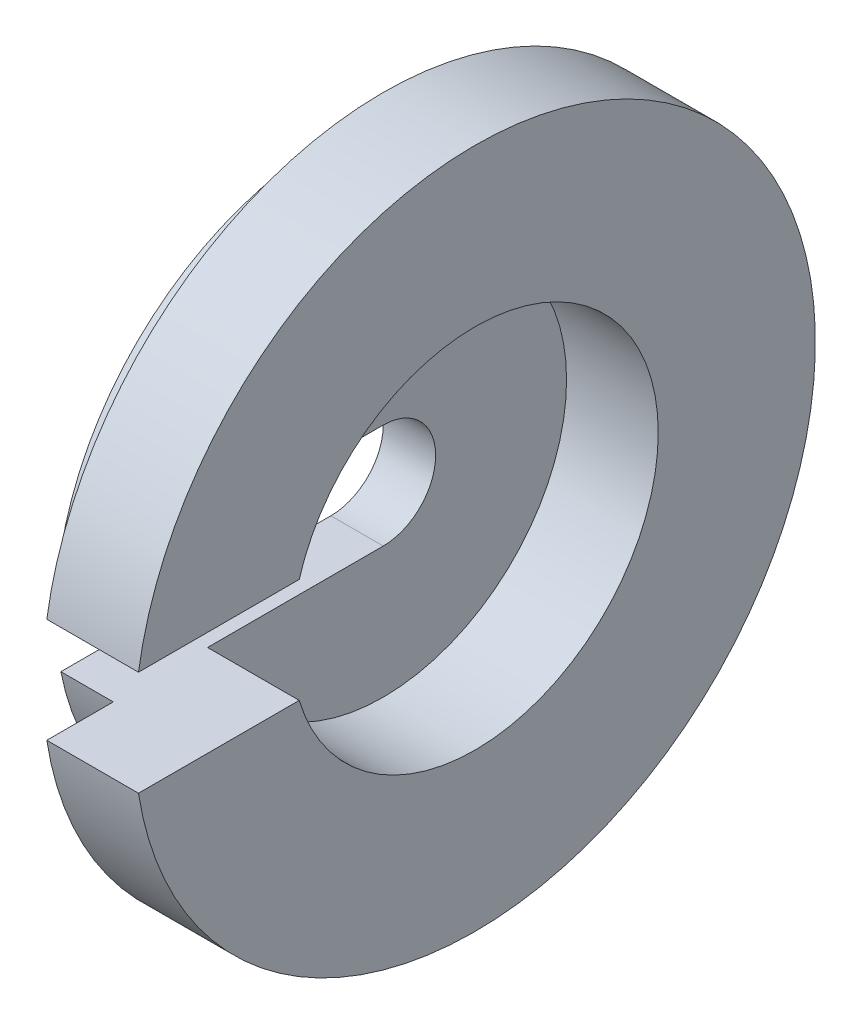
ISO-10303-21;
HEADER;
FILE_DESCRIPTION(('STEP AP214'),'2;1');
FILE_NAME('part.step','',(''),(''),'','','');
FILE_SCHEMA(('AUTOMOTIVE_DESIGN { 1 0 10303 214 1 1 1 1 }'));
ENDSEC;
DATA;
#1=APPLICATION_CONTEXT('core data for automotive mechanical design processes');
#2=APPLICATION_PROTOCOL_DEFINITION('international standard','automotive_design',2000,#1);
#3=PRODUCT_CONTEXT('',#1,'mechanical');
#4=PRODUCT('Part','Part','',(#3));
#5=PRODUCT_RELATED_PRODUCT_CATEGORY('part','',(#4));
#6=PRODUCT_DEFINITION_FORMATION('','',#4);
#7=PRODUCT_DEFINITION_CONTEXT('part definition',#1,'design');
#8=PRODUCT_DEFINITION('design','',#6,#7);
#9=PRODUCT_DEFINITION_SHAPE('','',#8);
#10=(LENGTH_UNIT() NAMED_UNIT(*) SI_UNIT(.MILLI.,.METRE.));
#11=(NAMED_UNIT(*) PLANE_ANGLE_UNIT() SI_UNIT($,.RADIAN.));
#12=(NAMED_UNIT(*) SI_UNIT($,.STERADIAN.) SOLID_ANGLE_UNIT());
#13=UNCERTAINTY_MEASURE_WITH_UNIT(LENGTH_MEASURE(1.E-05),#10,'distance_accuracy_value','');
#14=(GEOMETRIC_REPRESENTATION_CONTEXT(3) GLOBAL_UNCERTAINTY_ASSIGNED_CONTEXT((#13)) GLOBAL_UNIT_ASSIGNED_CONTEXT((#10,
#11,#12)) REPRESENTATION_CONTEXT('',''));
#15=CARTESIAN_POINT('',(0.,0.,0.));
#16=DIRECTION('',(0.,0.,1.));
#17=DIRECTION('',(1.,0.,0.));
#18=AXIS2_PLACEMENT_3D('',#15,#16,#17);
#19=CARTESIAN_POINT('',(0.,0.,0.));
#20=DIRECTION('',(1.,0.,0.));
#21=DIRECTION('',(0.,0.,-1.));
#22=AXIS2_PLACEMENT_3D('',#19,#20,#21);
#23=PLANE('',#22);
#24=CARTESIAN_POINT('',(0.,0.,0.));
#25=DIRECTION('',(1.,0.,0.));
#26=DIRECTION('',(0.,0.,-1.));
#27=AXIS2_PLACEMENT_3D('',#24,#25,#26);
#28=CIRCLE('',#27,2.);
#29=CARTESIAN_POINT('',(0.,-2.,0.));
#30=VERTEX_POINT('',#29);
#31=CARTESIAN_POINT('',(0.,2.,0.));
#32=VERTEX_POINT('',#31);
#33=EDGE_CURVE('E20',#30,#32,#28,.T.);
#34=ORIENTED_EDGE('',*,*,#33,.T.);
#35=DIRECTION('',(0.,0.,1.));
#36=VECTOR('',#35,1.);
#37=CARTESIAN_POINT('',(0.,2.,0.));
#38=LINE('',#37,#36);
#39=CARTESIAN_POINT('',(0.,2.,10.3077640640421));
#40=VERTEX_POINT('',#39);
#41=EDGE_CURVE('E80',#32,#40,#38,.T.);
#42=ORIENTED_EDGE('',*,*,#41,.T.);
#43=CARTESIAN_POINT('',(0.,0.,0.));
#44=DIRECTION('',(1.,0.,0.));
#45=DIRECTION('',(0.,0.,-1.));
#46=AXIS2_PLACEMENT_3D('',#43,#44,#45);
#47=CIRCLE('',#46,10.5);
#48=CARTESIAN_POINT('',(0.,-2.,10.3077640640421));
#49=VERTEX_POINT('',#48);
#50=EDGE_CURVE('E120',#49,#40,#47,.T.);
#51=ORIENTED_EDGE('',*,*,#50,.F.);
#52=DIRECTION('',(0.,0.,-1.));
#53=VECTOR('',#52,1.);
#54=CARTESIAN_POINT('',(0.,-2.,12.84523257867));
#55=LINE('',#54,#53);
#56=EDGE_CURVE('E83',#49,#30,#55,.T.);
#57=ORIENTED_EDGE('',*,*,#56,.T.);
#58=EDGE_LOOP('',(#34,#42,#51,#57));
#59=FACE_BOUND('',#58,.T.);
#60=ADVANCED_FACE('F16',(#59),#23,.F.);
#61=CARTESIAN_POINT('',(0.,0.,0.));
#62=DIRECTION('',(1.,0.,0.));
#63=DIRECTION('',(0.,0.,-1.));
#64=AXIS2_PLACEMENT_3D('',#61,#62,#63);
#65=CYLINDRICAL_SURFACE('',#64,2.);
#66=CARTESIAN_POINT('',(2.,0.,0.));
#67=DIRECTION('',(1.,0.,0.));
#68=DIRECTION('',(0.,0.,-1.));
#69=AXIS2_PLACEMENT_3D('',#66,#67,#68);
#70=CIRCLE('',#69,2.);
#71=CARTESIAN_POINT('',(2.,2.,0.));
#72=VERTEX_POINT('',#71);
#73=CARTESIAN_POINT('',(2.,-2.,0.));
#74=VERTEX_POINT('',#73);
#75=EDGE_CURVE('E86',#72,#74,#70,.F.);
#76=ORIENTED_EDGE('',*,*,#75,.F.);
#77=DIRECTION('',(1.,0.,0.));
#78=VECTOR('',#77,1.);
#79=CARTESIAN_POINT('',(0.,2.,0.));
#80=LINE('',#79,#78);
#81=EDGE_CURVE('E88',#72,#32,#80,.F.);
#82=ORIENTED_EDGE('',*,*,#81,.T.);
#83=ORIENTED_EDGE('',*,*,#33,.F.);
#84=DIRECTION('',(1.,0.,0.));
#85=VECTOR('',#84,1.);
#86=CARTESIAN_POINT('',(0.,-2.,0.));
#87=LINE('',#86,#85);
#88=EDGE_CURVE('E130',#30,#74,#87,.T.);
#89=ORIENTED_EDGE('',*,*,#88,.T.);
#90=EDGE_LOOP('',(#76,#82,#83,#89));
#91=FACE_BOUND('',#90,.T.);
#92=ADVANCED_FACE('F89',(#91),#65,.F.);
#93=CARTESIAN_POINT('',(2.,0.,0.));
#94=DIRECTION('',(1.,0.,0.));
#95=DIRECTION('',(0.,0.,-1.));
#96=AXIS2_PLACEMENT_3D('',#93,#94,#95);
#97=PLANE('',#96);
#98=ORIENTED_EDGE('',*,*,#75,.T.);
#99=DIRECTION('',(0.,0.,-1.));
#100=VECTOR('',#99,1.);
#101=CARTESIAN_POINT('',(2.,-2.,12.84523257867));
#102=LINE('',#101,#100);
#103=CARTESIAN_POINT('',(2.,-2.,6.70820393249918));
#104=VERTEX_POINT('',#103);
#105=EDGE_CURVE('E125',#74,#104,#102,.F.);
#106=ORIENTED_EDGE('',*,*,#105,.T.);
#107=CARTESIAN_POINT('',(2.,0.,0.));
#108=DIRECTION('',(1.,0.,0.));
#109=DIRECTION('',(0.,0.,-1.));
#110=AXIS2_PLACEMENT_3D('',#107,#108,#109);
#111=CIRCLE('',#110,7.);
#112=CARTESIAN_POINT('',(2.,2.00000000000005,6.70820393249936));
#113=VERTEX_POINT('',#112);
#114=EDGE_CURVE('E94',#104,#113,#111,.T.);
#115=ORIENTED_EDGE('',*,*,#114,.T.);
#116=DIRECTION('',(0.,0.,1.));
#117=VECTOR('',#116,1.);
#118=CARTESIAN_POINT('',(2.,2.,0.));
#119=LINE('',#118,#117);
#120=EDGE_CURVE('E95',#113,#72,#119,.F.);
#121=ORIENTED_EDGE('',*,*,#120,.T.);
#122=EDGE_LOOP('',(#98,#106,#115,#121));
#123=FACE_BOUND('',#122,.T.);
#124=ADVANCED_FACE('F124',(#123),#97,.T.);
#125=CARTESIAN_POINT('',(2.,0.,0.));
#126=DIRECTION('',(1.,0.,0.));
#127=DIRECTION('',(0.,0.,-1.));
#128=AXIS2_PLACEMENT_3D('',#125,#126,#127);
#129=PLANE('',#128);
#130=CARTESIAN_POINT('',(2.,0.,0.));
#131=DIRECTION('',(1.,0.,0.));
#132=DIRECTION('',(0.,0.,-1.));
#133=AXIS2_PLACEMENT_3D('',#130,#131,#132);
#134=CIRCLE('',#133,10.5);
#135=CARTESIAN_POINT('',(2.,2.,10.3077640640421));
#136=VERTEX_POINT('',#135);
#137=CARTESIAN_POINT('',(2.,-2.,10.3077640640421));
#138=VERTEX_POINT('',#137);
#139=EDGE_CURVE('E107',#136,#138,#134,.F.);
#140=ORIENTED_EDGE('',*,*,#139,.F.);
#141=DIRECTION('',(0.,0.,1.));
#142=VECTOR('',#141,1.);
#143=CARTESIAN_POINT('',(2.,2.,0.));
#144=LINE('',#143,#142);
#145=CARTESIAN_POINT('',(2.,2.,12.8452325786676));
#146=VERTEX_POINT('',#145);
#147=EDGE_CURVE('E104',#136,#146,#144,.T.);
#148=ORIENTED_EDGE('',*,*,#147,.T.);
#149=CARTESIAN_POINT('',(2.,0.,0.));
#150=DIRECTION('',(1.,0.,0.));
#151=DIRECTION('',(0.,0.,-1.));
#152=AXIS2_PLACEMENT_3D('',#149,#150,#151);
#153=CIRCLE('',#152,13.);
#154=CARTESIAN_POINT('',(2.,-2.,12.8452325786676));
#155=VERTEX_POINT('',#154);
#156=EDGE_CURVE('E102',#155,#146,#153,.T.);
#157=ORIENTED_EDGE('',*,*,#156,.F.);
#158=DIRECTION('',(0.,0.,-1.));
#159=VECTOR('',#158,1.);
#160=CARTESIAN_POINT('',(2.,-2.,12.84523257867));
#161=LINE('',#160,#159);
#162=EDGE_CURVE('E150',#155,#138,#161,.T.);
#163=ORIENTED_EDGE('',*,*,#162,.T.);
#164=EDGE_LOOP('',(#140,#148,#157,#163));
#165=FACE_BOUND('',#164,.T.);
#166=ADVANCED_FACE('F161',(#165),#129,.F.);
#167=CARTESIAN_POINT('',(0.,0.,0.));
#168=DIRECTION('',(1.,0.,0.));
#169=DIRECTION('',(0.,0.,-1.));
#170=AXIS2_PLACEMENT_3D('',#167,#168,#169);
#171=CYLINDRICAL_SURFACE('',#170,10.5);
#172=DIRECTION('',(1.,0.,0.));
#173=VECTOR('',#172,1.);
#174=CARTESIAN_POINT('',(0.,2.,10.30776406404));
#175=LINE('',#174,#173);
#176=EDGE_CURVE('E101',#40,#136,#175,.T.);
#177=ORIENTED_EDGE('',*,*,#176,.T.);
#178=ORIENTED_EDGE('',*,*,#139,.T.);
#179=DIRECTION('',(1.,0.,0.));
#180=VECTOR('',#179,1.);
#181=CARTESIAN_POINT('',(0.,-2.,10.30776406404));
#182=LINE('',#181,#180);
#183=EDGE_CURVE('E115',#138,#49,#182,.F.);
#184=ORIENTED_EDGE('',*,*,#183,.T.);
#185=ORIENTED_EDGE('',*,*,#50,.T.);
#186=EDGE_LOOP('',(#177,#178,#184,#185));
#187=FACE_BOUND('',#186,.T.);
#188=ADVANCED_FACE('F160',(#187),#171,.T.);
#189=CARTESIAN_POINT('',(0.,0.,0.));
#190=DIRECTION('',(1.,0.,0.));
#191=DIRECTION('',(0.,0.,-1.));
#192=AXIS2_PLACEMENT_3D('',#189,#190,#191);
#193=CYLINDRICAL_SURFACE('',#192,13.);
#194=DIRECTION('',(1.,0.,0.));
#195=VECTOR('',#194,1.);
#196=CARTESIAN_POINT('',(0.,-2.,12.84523257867));
#197=LINE('',#196,#195);
#198=CARTESIAN_POINT('',(5.5,-2.,12.8452325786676));
#199=VERTEX_POINT('',#198);
#200=EDGE_CURVE('E134',#199,#155,#197,.F.);
#201=ORIENTED_EDGE('',*,*,#200,.T.);
#202=ORIENTED_EDGE('',*,*,#156,.T.);
#203=DIRECTION('',(1.,0.,0.));
#204=VECTOR('',#203,1.);
#205=CARTESIAN_POINT('',(0.,2.,12.84523257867));
#206=LINE('',#205,#204);
#207=CARTESIAN_POINT('',(5.5,2.,12.8452325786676));
#208=VERTEX_POINT('',#207);
#209=EDGE_CURVE('E141',#146,#208,#206,.T.);
#210=ORIENTED_EDGE('',*,*,#209,.T.);
#211=CARTESIAN_POINT('',(5.5,0.,0.));
#212=DIRECTION('',(1.,0.,0.));
#213=DIRECTION('',(0.,0.,-1.));
#214=AXIS2_PLACEMENT_3D('',#211,#212,#213);
#215=CIRCLE('',#214,13.);
#216=EDGE_CURVE('E113',#199,#208,#215,.T.);
#217=ORIENTED_EDGE('',*,*,#216,.F.);
#218=EDGE_LOOP('',(#201,#202,#210,#217));
#219=FACE_BOUND('',#218,.T.);
#220=ADVANCED_FACE('F169',(#219),#193,.T.);
#221=CARTESIAN_POINT('',(0.,2.,0.));
#222=DIRECTION('',(0.,1.,0.));
#223=DIRECTION('',(0.,0.,1.));
#224=AXIS2_PLACEMENT_3D('',#221,#222,#223);
#225=PLANE('',#224);
#226=ORIENTED_EDGE('',*,*,#120,.F.);
#227=DIRECTION('',(1.,0.,0.));
#228=VECTOR('',#227,1.);
#229=CARTESIAN_POINT('',(5.5,2.0000000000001,6.70820393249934));
#230=LINE('',#229,#228);
#231=CARTESIAN_POINT('',(5.5,2.00000000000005,6.70820393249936));
#232=VERTEX_POINT('',#231);
#233=EDGE_CURVE('E116',#113,#232,#230,.T.);
#234=ORIENTED_EDGE('',*,*,#233,.T.);
#235=DIRECTION('',(0.,0.,-1.));
#236=VECTOR('',#235,1.);
#237=CARTESIAN_POINT('',(5.5,2.,0.));
#238=LINE('',#237,#236);
#239=EDGE_CURVE('E112',#208,#232,#238,.T.);
#240=ORIENTED_EDGE('',*,*,#239,.F.);
#241=ORIENTED_EDGE('',*,*,#209,.F.);
#242=ORIENTED_EDGE('',*,*,#147,.F.);
#243=ORIENTED_EDGE('',*,*,#176,.F.);
#244=ORIENTED_EDGE('',*,*,#41,.F.);
#245=ORIENTED_EDGE('',*,*,#81,.F.);
#246=EDGE_LOOP('',(#226,#234,#240,#241,#242,#243,#244,#245));
#247=FACE_BOUND('',#246,.T.);
#248=ADVANCED_FACE('F98',(#247),#225,.F.);
#249=CARTESIAN_POINT('',(5.5,0.,0.));
#250=DIRECTION('',(1.,0.,0.));
#251=DIRECTION('',(0.,0.,-1.));
#252=AXIS2_PLACEMENT_3D('',#249,#250,#251);
#253=CYLINDRICAL_SURFACE('',#252,7.);
#254=DIRECTION('',(1.,0.,0.));
#255=VECTOR('',#254,1.);
#256=CARTESIAN_POINT('',(0.,-2.,6.708203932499));
#257=LINE('',#256,#255);
#258=CARTESIAN_POINT('',(5.5,-2.,6.70820393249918));
#259=VERTEX_POINT('',#258);
#260=EDGE_CURVE('E132',#104,#259,#257,.T.);
#261=ORIENTED_EDGE('',*,*,#260,.T.);
#262=CARTESIAN_POINT('',(5.5,0.,0.));
#263=DIRECTION('',(1.,0.,0.));
#264=DIRECTION('',(0.,0.,-1.));
#265=AXIS2_PLACEMENT_3D('',#262,#263,#264);
#266=CIRCLE('',#265,7.);
#267=EDGE_CURVE('E26',#232,#259,#266,.F.);
#268=ORIENTED_EDGE('',*,*,#267,.F.);
#269=ORIENTED_EDGE('',*,*,#233,.F.);
#270=ORIENTED_EDGE('',*,*,#114,.F.);
#271=EDGE_LOOP('',(#261,#268,#269,#270));
#272=FACE_BOUND('',#271,.T.);
#273=ADVANCED_FACE('F157',(#272),#253,.F.);
#274=CARTESIAN_POINT('',(0.,-2.,12.84523257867));
#275=DIRECTION('',(0.,-1.,0.));
#276=DIRECTION('',(0.,0.,-1.));
#277=AXIS2_PLACEMENT_3D('',#274,#275,#276);
#278=PLANE('',#277);
#279=ORIENTED_EDGE('',*,*,#162,.F.);
#280=ORIENTED_EDGE('',*,*,#200,.F.);
#281=DIRECTION('',(0.,0.,-1.));
#282=VECTOR('',#281,1.);
#283=CARTESIAN_POINT('',(5.5,-2.,0.));
#284=LINE('',#283,#282);
#285=EDGE_CURVE('E11',#259,#199,#284,.F.);
#286=ORIENTED_EDGE('',*,*,#285,.F.);
#287=ORIENTED_EDGE('',*,*,#260,.F.);
#288=ORIENTED_EDGE('',*,*,#105,.F.);
#289=ORIENTED_EDGE('',*,*,#88,.F.);
#290=ORIENTED_EDGE('',*,*,#56,.F.);
#291=ORIENTED_EDGE('',*,*,#183,.F.);
#292=EDGE_LOOP('',(#279,#280,#286,#287,#288,#289,#290,#291));
#293=FACE_BOUND('',#292,.T.);
#294=ADVANCED_FACE('F129',(#293),#278,.F.);
#295=CARTESIAN_POINT('',(5.5,0.,0.));
#296=DIRECTION('',(1.,0.,0.));
#297=DIRECTION('',(0.,0.,-1.));
#298=AXIS2_PLACEMENT_3D('',#295,#296,#297);
#299=PLANE('',#298);
#300=ORIENTED_EDGE('',*,*,#267,.T.);
#301=ORIENTED_EDGE('',*,*,#285,.T.);
#302=ORIENTED_EDGE('',*,*,#216,.T.);
#303=ORIENTED_EDGE('',*,*,#239,.T.);
#304=EDGE_LOOP('',(#300,#301,#302,#303));
#305=FACE_BOUND('',#304,.T.);
#306=ADVANCED_FACE('F18',(#305),#299,.T.);
#307=CLOSED_SHELL('',(#60,#92,#124,#166,#188,#220,#248,#273,#294,#306));
#308=MANIFOLD_SOLID_BREP('B1',#307);
#309=ADVANCED_BREP_SHAPE_REPRESENTATION('',(#18,#308),#14);
#310=SHAPE_DEFINITION_REPRESENTATION(#9,#309);
ENDSEC;
END-ISO-10303-21;
